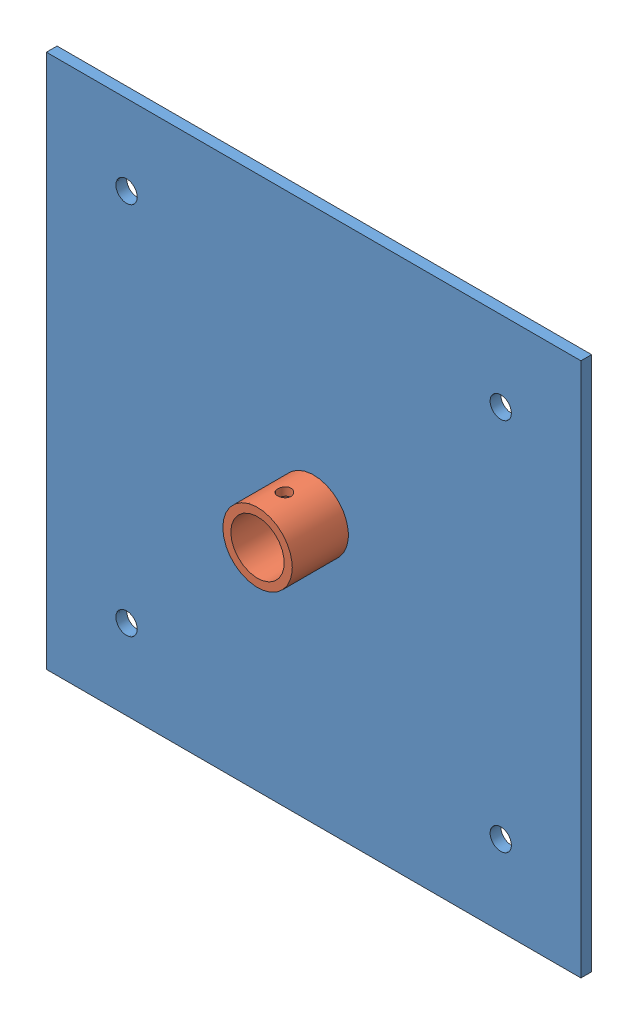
SolidWorks assembly Ancrage.SLDASM, configuration Défaut (file format 3100). Lengths in mm.
Overall size (200 200 25).
2 component instances, 2 part files, 3 mates.
Components (placement in the parent):
- Plaque d'ancrage-1: Plaque d'ancrage.SLDPRT [Défaut] at (-120.6874 -104.7826 0) size (200 200 4)
- Tube d'ancrage-1: Tube d'ancrage.SLDPRT [Défaut] at (-20.6874 -4.7826 4) size (26 26 21)
Mates (geometry in assembly coordinates):
- Coïncidente1: coincident anti-aligned: plane of Plaque d'ancrage-1 through (-120.6874 95.2174 4) normal (0 0 1); plane of Tube d'ancrage-1 through (-20.6874 -4.7826 4) normal (0 0 -1)
- Distance1: distance = 100 mm: axis of Tube d'ancrage-1; line of Plaque d'ancrage-1
- Distance2: distance = 100 mm: line of Plaque d'ancrage-1; axis of Tube d'ancrage-1
